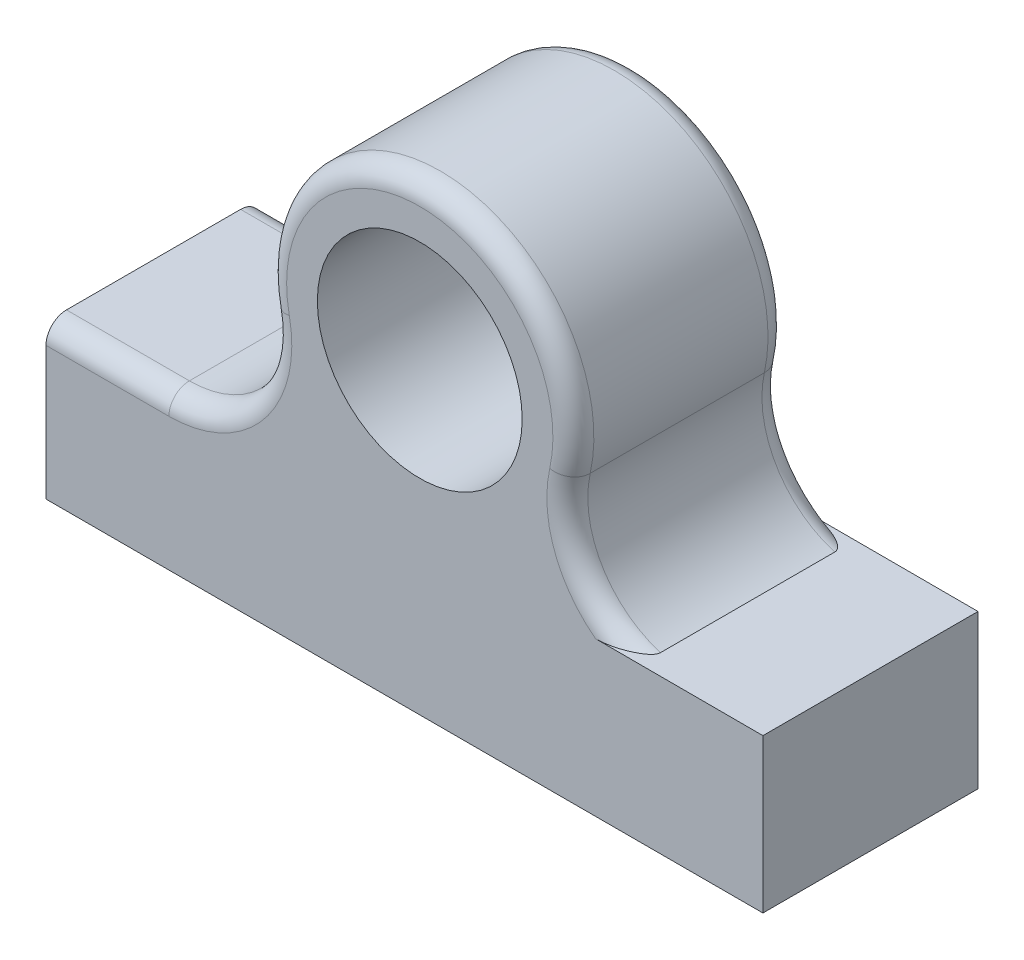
from build123d import *

# Parameters (mm, degrees)
CROQUIS1_R     = 10
EXTRUIR1_DEPTH = 21
REDONDEO1_R    = 2


with BuildPart() as part:
    # Croquis1 → Extruir1 (new body)
    with BuildSketch(Plane.XY):
        with BuildLine():
            Line((33.505102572, 3.997713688), (-36.494897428, 3.997713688))
            Line((-36.494897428, 3.997713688), (-36.494897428, 18.997713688))
            Line((-36.494897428, 18.997713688), (-24.494897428, 18.997713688))
            ThreePointArc((-24.494897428, 18.997713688), (-16.748930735, 22.673158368), (-14.696938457, 30.997713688))
            ThreePointArc((-14.696938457, 30.997713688), (0.126587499, 48.997179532), (14.644211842, 30.750090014))
            ThreePointArc((14.644211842, 30.750090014), (15.774232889, 23.537731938), (21.505102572, 19.015322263))
            Line((21.505102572, 19.015322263), (33.505102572, 18.997713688))
            Line((33.505102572, 18.997713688), (33.505102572, 3.997713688))
        make_face()
        with Locations((0, 33.997713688)):
            Circle(CROQUIS1_R, mode=Mode.SUBTRACT)
    extrude(amount=EXTRUIR1_DEPTH)

    # Redondeo1
    redondeo1_edges = [part.edges().sort_by_distance(p)[0] for p in [
        (15.774232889, 23.537731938, 21),
        (0.126587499, 48.997179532, 21),
        (-16.748930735, 22.673158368, 21),
        (-30.494897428, 18.997713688, 21),
        (-30.494897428, 18.997713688, 0),
        (-16.748930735, 22.673158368, 0),
        (0.126587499, 48.997179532, 0),
        (15.774232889, 23.537731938, 0),
    ]]
    fillet(redondeo1_edges, radius=REDONDEO1_R)


solid = part.part
